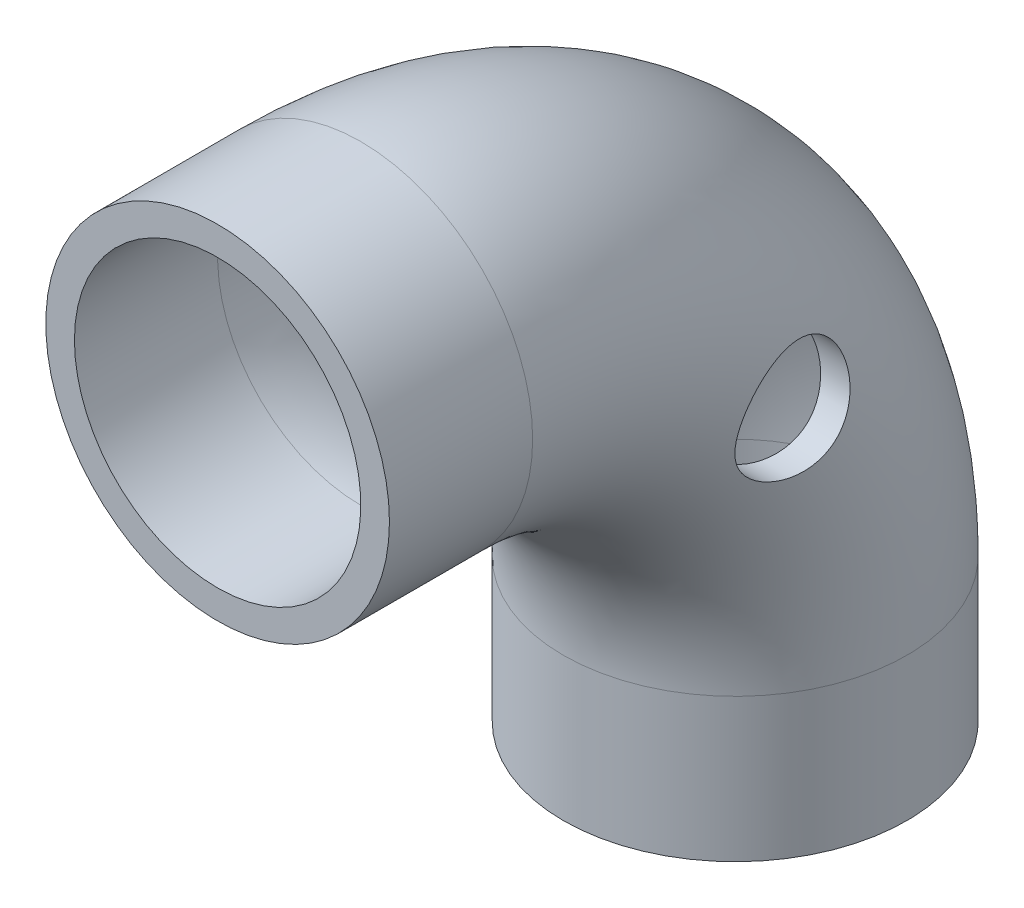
ISO-10303-21;
HEADER;
FILE_DESCRIPTION(('STEP AP214'),'2;1');
FILE_NAME('part.step','',(''),(''),'','','');
FILE_SCHEMA(('AUTOMOTIVE_DESIGN { 1 0 10303 214 1 1 1 1 }'));
ENDSEC;
DATA;
#1=APPLICATION_CONTEXT('core data for automotive mechanical design processes');
#2=APPLICATION_PROTOCOL_DEFINITION('international standard','automotive_design',2000,#1);
#3=PRODUCT_CONTEXT('',#1,'mechanical');
#4=PRODUCT('Part','Part','',(#3));
#5=PRODUCT_RELATED_PRODUCT_CATEGORY('part','',(#4));
#6=PRODUCT_DEFINITION_FORMATION('','',#4);
#7=PRODUCT_DEFINITION_CONTEXT('part definition',#1,'design');
#8=PRODUCT_DEFINITION('design','',#6,#7);
#9=PRODUCT_DEFINITION_SHAPE('','',#8);
#10=(LENGTH_UNIT() NAMED_UNIT(*) SI_UNIT(.MILLI.,.METRE.));
#11=(NAMED_UNIT(*) PLANE_ANGLE_UNIT() SI_UNIT($,.RADIAN.));
#12=(NAMED_UNIT(*) SI_UNIT($,.STERADIAN.) SOLID_ANGLE_UNIT());
#13=UNCERTAINTY_MEASURE_WITH_UNIT(LENGTH_MEASURE(1.E-05),#10,'distance_accuracy_value','');
#14=(GEOMETRIC_REPRESENTATION_CONTEXT(3) GLOBAL_UNCERTAINTY_ASSIGNED_CONTEXT((#13)) GLOBAL_UNIT_ASSIGNED_CONTEXT((#10,
#11,#12)) REPRESENTATION_CONTEXT('',''));
#15=CARTESIAN_POINT('',(0.,0.,0.));
#16=DIRECTION('',(0.,0.,1.));
#17=DIRECTION('',(1.,0.,0.));
#18=AXIS2_PLACEMENT_3D('',#15,#16,#17);
#19=CARTESIAN_POINT('',(0.,0.,0.));
#20=DIRECTION('',(0.,0.,-1.));
#21=DIRECTION('',(-1.,0.,0.));
#22=AXIS2_PLACEMENT_3D('',#19,#20,#21);
#23=PLANE('',#22);
#24=CARTESIAN_POINT('',(0.,30.4800000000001,0.));
#25=DIRECTION('',(0.,0.,-1.));
#26=DIRECTION('',(-1.,0.,0.));
#27=AXIS2_PLACEMENT_3D('',#24,#25,#26);
#28=CIRCLE('',#27,25.4000000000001);
#29=CARTESIAN_POINT('',(-25.4000000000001,30.4800000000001,0.));
#30=VERTEX_POINT('',#29);
#31=EDGE_CURVE('E125',#30,#30,#28,.F.);
#32=ORIENTED_EDGE('',*,*,#31,.F.);
#33=EDGE_LOOP('',(#32));
#34=FACE_BOUND('',#33,.T.);
#35=CARTESIAN_POINT('',(0.,30.4800000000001,0.));
#36=DIRECTION('',(0.,0.,1.));
#37=DIRECTION('',(1.,0.,0.));
#38=AXIS2_PLACEMENT_3D('',#35,#36,#37);
#39=CIRCLE('',#38,30.4800000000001);
#40=CARTESIAN_POINT('',(30.4800000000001,30.4800000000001,0.));
#41=VERTEX_POINT('',#40);
#42=EDGE_CURVE('E10',#41,#41,#39,.T.);
#43=ORIENTED_EDGE('',*,*,#42,.T.);
#44=EDGE_LOOP('',(#43));
#45=FACE_BOUND('',#44,.T.);
#46=ADVANCED_FACE('F45',(#34,#45),#23,.F.);
#47=CARTESIAN_POINT('',(0.,30.4800000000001,0.));
#48=DIRECTION('',(0.,0.,1.));
#49=DIRECTION('',(1.,0.,0.));
#50=AXIS2_PLACEMENT_3D('',#47,#48,#49);
#51=CYLINDRICAL_SURFACE('',#50,30.4800000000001);
#52=CARTESIAN_POINT('',(0.,30.4800000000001,-25.4));
#53=DIRECTION('',(0.,0.,-1.));
#54=DIRECTION('',(-1.,0.,0.));
#55=AXIS2_PLACEMENT_3D('',#52,#53,#54);
#56=CIRCLE('',#55,30.4800000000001);
#57=CARTESIAN_POINT('',(-30.4800000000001,30.4800000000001,-25.4));
#58=VERTEX_POINT('',#57);
#59=EDGE_CURVE('E65',#58,#58,#56,.T.);
#60=ORIENTED_EDGE('',*,*,#59,.F.);
#61=EDGE_LOOP('',(#60));
#62=FACE_BOUND('',#61,.T.);
#63=ORIENTED_EDGE('',*,*,#42,.F.);
#64=EDGE_LOOP('',(#63));
#65=FACE_BOUND('',#64,.T.);
#66=ADVANCED_FACE('F106',(#62,#65),#51,.T.);
#67=CARTESIAN_POINT('',(0.,-35.9210244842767,-25.3999999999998));
#68=DIRECTION('',(-1.,0.,0.));
#69=DIRECTION('',(0.,0.,1.));
#70=AXIS2_PLACEMENT_3D('',#67,#68,#69);
#71=TOROIDAL_SURFACE('',#70,66.4010244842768,30.4800000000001);
#72=CARTESIAN_POINT('',(-30.4689780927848,3.88097143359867,-79.5702494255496));
#73=CARTESIAN_POINT('',(-30.4762654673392,3.6861503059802,-79.3772379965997));
#74=CARTESIAN_POINT('',(-30.479977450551,3.49908839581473,-79.1762706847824));
#75=CARTESIAN_POINT('',(-30.4800223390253,3.14184741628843,-78.7598608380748));
#76=CARTESIAN_POINT('',(-30.476355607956,2.9716675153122,-78.544419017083));
#77=CARTESIAN_POINT('',(-30.4616046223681,2.64943083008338,-78.1006737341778));
#78=CARTESIAN_POINT('',(-30.4505214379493,2.49737143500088,-77.8723721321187));
#79=CARTESIAN_POINT('',(-30.4211001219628,2.21238547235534,-77.4045691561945));
#80=CARTESIAN_POINT('',(-30.4027618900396,2.07945916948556,-77.1650676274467));
#81=CARTESIAN_POINT('',(-30.3592192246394,1.83372408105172,-76.6769009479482));
#82=CARTESIAN_POINT('',(-30.3340224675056,1.72089303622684,-76.4282463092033));
#83=CARTESIAN_POINT('',(-30.2773126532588,1.5158095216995,-75.9232979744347));
#84=CARTESIAN_POINT('',(-30.2457996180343,1.42355698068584,-75.6670043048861));
#85=CARTESIAN_POINT('',(-30.1771980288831,1.26008522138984,-75.1485359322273));
#86=CARTESIAN_POINT('',(-30.1401095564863,1.18886569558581,-74.8863613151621));
#87=CARTESIAN_POINT('',(-30.0612456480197,1.06772179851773,-74.3577310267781));
#88=CARTESIAN_POINT('',(-30.0194683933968,1.01780572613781,-74.091273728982));
#89=CARTESIAN_POINT('',(-29.9312401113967,0.938518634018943,-73.5493911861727));
#90=CARTESIAN_POINT('',(-29.8847010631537,0.909668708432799,-73.2739040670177));
#91=CARTESIAN_POINT('',(-29.7890544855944,0.874531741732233,-72.721818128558));
#92=CARTESIAN_POINT('',(-29.7399458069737,0.868254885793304,-72.4452188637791));
#93=CARTESIAN_POINT('',(-29.6405409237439,0.878247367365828,-71.8926026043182));
#94=CARTESIAN_POINT('',(-29.5902445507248,0.894519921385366,-71.6165856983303));
#95=CARTESIAN_POINT('',(-29.4899270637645,0.949503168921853,-71.0667442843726));
#96=CARTESIAN_POINT('',(-29.4399059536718,0.988214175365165,-70.7929198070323));
#97=CARTESIAN_POINT('',(-29.3393428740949,1.09024718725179,-70.2362284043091));
#98=CARTESIAN_POINT('',(-29.2888869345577,1.15464046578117,-69.9535414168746));
#99=CARTESIAN_POINT('',(-29.1917258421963,1.3075223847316,-69.3942155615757));
#100=CARTESIAN_POINT('',(-29.1450192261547,1.39600156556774,-69.1175743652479));
#101=CARTESIAN_POINT('',(-29.0570766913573,1.59665824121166,-68.5721262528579));
#102=CARTESIAN_POINT('',(-29.0158405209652,1.70883464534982,-68.3033189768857));
#103=CARTESIAN_POINT('',(-28.9404777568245,1.95630642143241,-67.7755236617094));
#104=CARTESIAN_POINT('',(-28.9063508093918,2.09160064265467,-67.5165351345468));
#105=CARTESIAN_POINT('',(-28.8474683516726,2.38046329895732,-67.0174069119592));
#106=CARTESIAN_POINT('',(-28.8224809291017,2.53342685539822,-66.7769447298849));
#107=CARTESIAN_POINT('',(-28.7816453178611,2.85943693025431,-66.3092079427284));
#108=CARTESIAN_POINT('',(-28.7657969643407,3.03248308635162,-66.0819330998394));
#109=CARTESIAN_POINT('',(-28.7439390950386,3.39728359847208,-65.6425884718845));
#110=CARTESIAN_POINT('',(-28.7379251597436,3.5890295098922,-65.430511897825));
#111=CARTESIAN_POINT('',(-28.7359927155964,3.98973514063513,-65.0232579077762));
#112=CARTESIAN_POINT('',(-28.7400737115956,4.19869401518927,-64.8280796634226));
#113=CARTESIAN_POINT('',(-28.7575270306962,4.61727299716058,-64.4689014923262));
#114=CARTESIAN_POINT('',(-28.770247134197,4.82587736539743,-64.3036832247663));
#115=CARTESIAN_POINT('',(-28.8037993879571,5.25495511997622,-63.9903993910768));
#116=CARTESIAN_POINT('',(-28.8246311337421,5.47542791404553,-63.842332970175));
#117=CARTESIAN_POINT('',(-28.8736352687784,5.92667624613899,-63.5642301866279));
#118=CARTESIAN_POINT('',(-28.9018077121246,6.15745186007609,-63.4341939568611));
#119=CARTESIAN_POINT('',(-28.9645065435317,6.62783862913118,-63.1927844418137));
#120=CARTESIAN_POINT('',(-28.9990354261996,6.86745322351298,-63.08141851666));
#121=CARTESIAN_POINT('',(-29.0739889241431,7.35857157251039,-62.8759731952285));
#122=CARTESIAN_POINT('',(-29.1145135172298,7.61021497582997,-62.782264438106));
#123=CARTESIAN_POINT('',(-29.1996335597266,8.11960330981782,-62.6151705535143));
#124=CARTESIAN_POINT('',(-29.2442307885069,8.37735087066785,-62.5417943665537));
#125=CARTESIAN_POINT('',(-29.3360998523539,8.89739743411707,-62.4156929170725));
#126=CARTESIAN_POINT('',(-29.3833718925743,9.15969678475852,-62.3629692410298));
#127=CARTESIAN_POINT('',(-29.4791995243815,9.68740869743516,-62.2783806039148));
#128=CARTESIAN_POINT('',(-29.5277551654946,9.95282137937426,-62.2465164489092));
#129=CARTESIAN_POINT('',(-29.62825244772,10.5043451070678,-62.2022699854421));
#130=CARTESIAN_POINT('',(-29.6801887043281,10.7905828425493,-62.191438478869));
#131=CARTESIAN_POINT('',(-29.7823592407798,11.3631519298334,-62.1939926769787));
#132=CARTESIAN_POINT('',(-29.8325940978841,11.6494832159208,-62.2073700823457));
#133=CARTESIAN_POINT('',(-29.9299049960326,12.2205948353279,-62.2583553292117));
#134=CARTESIAN_POINT('',(-29.9769803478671,12.5053748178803,-62.2959684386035));
#135=CARTESIAN_POINT('',(-30.0666061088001,13.0714159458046,-62.3953422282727));
#136=CARTESIAN_POINT('',(-30.1091566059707,13.3526771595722,-62.4571024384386));
#137=CARTESIAN_POINT('',(-30.1886359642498,13.9103363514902,-62.6047021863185));
#138=CARTESIAN_POINT('',(-30.2255517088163,14.1867216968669,-62.6905966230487));
#139=CARTESIAN_POINT('',(-30.292641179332,14.7318824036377,-62.8859745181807));
#140=CARTESIAN_POINT('',(-30.3228148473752,15.0006576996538,-62.995458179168));
#141=CARTESIAN_POINT('',(-30.3756300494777,15.5283834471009,-63.2373159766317));
#142=CARTESIAN_POINT('',(-30.3982738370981,15.7873368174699,-63.3696832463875));
#143=CARTESIAN_POINT('',(-30.4355024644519,16.2933675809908,-63.6564168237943));
#144=CARTESIAN_POINT('',(-30.4500876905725,16.5404455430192,-63.8107820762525));
#145=CARTESIAN_POINT('',(-30.4703873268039,17.0083742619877,-64.131908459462));
#146=CARTESIAN_POINT('',(-30.4765172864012,17.2299201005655,-64.2976317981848));
#147=CARTESIAN_POINT('',(-30.4812468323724,17.6588000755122,-64.6466353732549));
#148=CARTESIAN_POINT('',(-30.4798466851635,17.866134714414,-64.8299149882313));
#149=CARTESIAN_POINT('',(-30.469692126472,18.2650569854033,-65.2126591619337));
#150=CARTESIAN_POINT('',(-30.46093819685,18.4566456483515,-65.4121226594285));
#151=CARTESIAN_POINT('',(-30.4364374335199,18.8227370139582,-65.8257540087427));
#152=CARTESIAN_POINT('',(-30.420690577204,18.9972396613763,-66.0399219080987));
#153=CARTESIAN_POINT('',(-30.3830364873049,19.325295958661,-66.4777815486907));
#154=CARTESIAN_POINT('',(-30.3612335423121,19.4791440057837,-66.7012619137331));
#155=CARTESIAN_POINT('',(-30.3119857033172,19.7682873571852,-67.1594333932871));
#156=CARTESIAN_POINT('',(-30.2845387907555,19.9035759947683,-67.3941284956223));
#157=CARTESIAN_POINT('',(-30.2247414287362,20.1547563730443,-67.8730446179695));
#158=CARTESIAN_POINT('',(-30.1923914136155,20.2706498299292,-68.1172647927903));
#159=CARTESIAN_POINT('',(-30.1235951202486,20.4824492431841,-68.6136721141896));
#160=CARTESIAN_POINT('',(-30.0871486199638,20.5783541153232,-68.865859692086));
#161=CARTESIAN_POINT('',(-30.009710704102,20.7526640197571,-69.3854626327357));
#162=CARTESIAN_POINT('',(-29.9686056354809,20.8303483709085,-69.6531029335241));
#163=CARTESIAN_POINT('',(-29.8839482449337,20.9634205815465,-70.1934974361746));
#164=CARTESIAN_POINT('',(-29.8403958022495,21.0188073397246,-70.4662518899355));
#165=CARTESIAN_POINT('',(-29.7518731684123,21.1070186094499,-71.0152135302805));
#166=CARTESIAN_POINT('',(-29.7069026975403,21.1398386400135,-71.2914213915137));
#167=CARTESIAN_POINT('',(-29.6166031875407,21.1827331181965,-71.8455406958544));
#168=CARTESIAN_POINT('',(-29.5712741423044,21.1928071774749,-72.1234521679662));
#169=CARTESIAN_POINT('',(-29.4796485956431,21.1900900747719,-72.6895370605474));
#170=CARTESIAN_POINT('',(-29.4333780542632,21.1764420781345,-72.9777110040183));
#171=CARTESIAN_POINT('',(-29.3427580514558,21.1246624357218,-73.552026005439));
#172=CARTESIAN_POINT('',(-29.2984077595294,21.0865414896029,-73.83816789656));
#173=CARTESIAN_POINT('',(-29.212707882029,20.9859644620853,-74.4067354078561));
#174=CARTESIAN_POINT('',(-29.1713595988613,20.9234978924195,-74.6891593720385));
#175=CARTESIAN_POINT('',(-29.0927672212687,20.7745639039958,-75.2480708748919));
#176=CARTESIAN_POINT('',(-29.055521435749,20.6881064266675,-75.5245608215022));
#177=CARTESIAN_POINT('',(-28.9863276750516,20.4923005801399,-76.0679068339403));
#178=CARTESIAN_POINT('',(-28.9543462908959,20.3831073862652,-76.3348145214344));
#179=CARTESIAN_POINT('',(-28.8962409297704,20.1421396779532,-76.8589067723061));
#180=CARTESIAN_POINT('',(-28.8701169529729,20.0103651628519,-77.1160913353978));
#181=CARTESIAN_POINT('',(-28.8244505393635,19.7251324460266,-77.6186746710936));
#182=CARTESIAN_POINT('',(-28.8049064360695,19.5716797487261,-77.8640764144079));
#183=CARTESIAN_POINT('',(-28.7729410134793,19.2441522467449,-78.3411992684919));
#184=CARTESIAN_POINT('',(-28.7605194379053,19.0700781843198,-78.5729208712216));
#185=CARTESIAN_POINT('',(-28.7434965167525,18.7098973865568,-79.0119389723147));
#186=CARTESIAN_POINT('',(-28.7386050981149,18.5245396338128,-79.2198392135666));
#187=CARTESIAN_POINT('',(-28.7358475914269,18.1373580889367,-79.6197402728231));
#188=CARTESIAN_POINT('',(-28.7379813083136,17.9355347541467,-79.8117415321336));
#189=CARTESIAN_POINT('',(-28.7492165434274,17.5169382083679,-80.1784230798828));
#190=CARTESIAN_POINT('',(-28.7583174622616,17.3001662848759,-80.3531048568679));
#191=CARTESIAN_POINT('',(-28.7832451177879,16.8532781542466,-80.6839313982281));
#192=CARTESIAN_POINT('',(-28.7990718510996,16.6231619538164,-80.8400761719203));
#193=CARTESIAN_POINT('',(-28.8367201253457,16.1552311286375,-81.1303389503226));
#194=CARTESIAN_POINT('',(-28.8584373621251,15.917608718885,-81.2647806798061));
#195=CARTESIAN_POINT('',(-28.9074447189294,15.4326954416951,-81.5139578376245));
#196=CARTESIAN_POINT('',(-28.9347368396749,15.185401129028,-81.6286861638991));
#197=CARTESIAN_POINT('',(-28.9942250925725,14.6829337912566,-81.8377255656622));
#198=CARTESIAN_POINT('',(-29.0264207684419,14.4277615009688,-81.932038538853));
#199=CARTESIAN_POINT('',(-29.094958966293,13.911180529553,-82.0997843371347));
#200=CARTESIAN_POINT('',(-29.1313017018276,13.6497715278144,-82.173216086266));
#201=CARTESIAN_POINT('',(-29.2083949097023,13.1147530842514,-82.3006709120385));
#202=CARTESIAN_POINT('',(-29.2492424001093,12.8410093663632,-82.3540718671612));
#203=CARTESIAN_POINT('',(-29.3334679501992,12.2904354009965,-82.4381720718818));
#204=CARTESIAN_POINT('',(-29.3768461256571,12.013605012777,-82.4688702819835));
#205=CARTESIAN_POINT('',(-29.46512277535,11.4585503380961,-82.5074515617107));
#206=CARTESIAN_POINT('',(-29.5100215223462,11.1803258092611,-82.5153305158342));
#207=CARTESIAN_POINT('',(-29.6002889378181,10.6242423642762,-82.5082531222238));
#208=CARTESIAN_POINT('',(-29.6456576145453,10.3463834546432,-82.4932963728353));
#209=CARTESIAN_POINT('',(-29.7374241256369,9.78282260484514,-82.4396921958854));
#210=CARTESIAN_POINT('',(-29.7838007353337,9.49719557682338,-82.4002166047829));
#211=CARTESIAN_POINT('',(-29.8747383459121,8.93017662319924,-82.2970936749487));
#212=CARTESIAN_POINT('',(-29.9193001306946,8.64878290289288,-82.2334568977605));
#213=CARTESIAN_POINT('',(-30.0055046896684,8.09186454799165,-82.082306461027));
#214=CARTESIAN_POINT('',(-30.0471460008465,7.8163429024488,-81.9947809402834));
#215=CARTESIAN_POINT('',(-30.1263587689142,7.27335661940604,-81.7963847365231));
#216=CARTESIAN_POINT('',(-30.1639318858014,7.00588872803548,-81.685523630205));
#217=CARTESIAN_POINT('',(-30.2341526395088,6.47955107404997,-81.4404757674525));
#218=CARTESIAN_POINT('',(-30.2667751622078,6.22073002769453,-81.3061770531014));
#219=CARTESIAN_POINT('',(-30.3258991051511,5.71506309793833,-81.0154772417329));
#220=CARTESIAN_POINT('',(-30.3524004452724,5.46821737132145,-80.8590758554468));
#221=CARTESIAN_POINT('',(-30.3984231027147,4.98856098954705,-80.5252971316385));
#222=CARTESIAN_POINT('',(-30.4179467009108,4.75574576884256,-80.3479266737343));
#223=CARTESIAN_POINT('',(-30.4493321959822,4.30599423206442,-79.9734785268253));
#224=CARTESIAN_POINT('',(-30.4611945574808,4.08905695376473,-79.7764020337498));
#225=CARTESIAN_POINT('',(-30.4689780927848,3.88097143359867,-79.5702494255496));
#226=B_SPLINE_CURVE_WITH_KNOTS('',3,(#72,#73,#74,#75,#76,#77,#78,#79,#80,#81,#82,#83,#84,#85,
#86,#87,#88,#89,#90,#91,#92,#93,#94,#95,#96,#97,#98,#99,#100,#101,#102,#103,#104,#105,#106,#107,
#108,#109,#110,#111,#112,#113,#114,#115,#116,#117,#118,#119,#120,#121,#122,#123,#124,#125,#126,
#127,#128,#129,#130,#131,#132,#133,#134,#135,#136,#137,#138,#139,#140,#141,#142,#143,#144,#145,
#146,#147,#148,#149,#150,#151,#152,#153,#154,#155,#156,#157,#158,#159,#160,#161,#162,#163,#164,
#165,#166,#167,#168,#169,#170,#171,#172,#173,#174,#175,#176,#177,#178,#179,#180,#181,#182,#183,
#184,#185,#186,#187,#188,#189,#190,#191,#192,#193,#194,#195,#196,#197,#198,#199,#200,#201,#202,
#203,#204,#205,#206,#207,#208,#209,#210,#211,#212,#213,#214,#215,#216,#217,#218,#219,#220,#221,
#222,#223,#224,#225),.UNSPECIFIED.,.T.,.F.,(4,2,2,2,2,2,2,2,2,2,2,2,2,2,2,2,2,2,2,2,2,2,2,2,2,2,
2,2,2,2,2,2,2,2,2,2,2,2,2,2,2,2,2,2,2,2,2,2,2,2,2,2,2,2,2,2,2,2,2,2,2,2,2,2,2,2,2,2,2,2,2,2,2,2,
2,2,4),(0.,0.822752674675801,1.64546480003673,2.46805824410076,3.2906630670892,4.11235095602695,
4.93403599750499,5.7557090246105,6.57770184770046,7.41939602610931,8.26146993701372,
9.10366397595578,9.94586976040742,10.8276619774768,11.7091083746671,12.5905142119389,
13.4718761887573,14.3289999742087,15.1861082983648,16.0428313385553,16.8995123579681,
17.6978051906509,18.4960582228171,19.2943171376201,20.0928900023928,20.9067096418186,
21.7208865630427,22.5351260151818,23.3493969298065,24.2217171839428,25.0937384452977,
25.9659493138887,26.8381432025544,27.7123373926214,28.5865390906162,29.4604789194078,
30.3343768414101,31.1635788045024,31.9927514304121,32.821869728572,33.6509907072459,
34.4666354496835,35.2825724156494,36.0984371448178,36.9143461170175,37.7584981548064,
38.6026918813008,39.4470531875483,40.291428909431,41.1669403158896,42.0420692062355,
42.9175755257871,43.7927195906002,44.6620757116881,45.531431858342,46.4005676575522,
47.269672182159,48.1043765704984,48.939057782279,49.7736671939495,50.6082761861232,
51.4289757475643,52.2499703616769,53.0708886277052,53.8918491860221,54.7365313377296,
55.5812521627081,56.4261253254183,57.2710133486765,58.1461187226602,59.0208420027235,
59.8960003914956,60.7708003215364,61.6498995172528,62.5290102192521,63.4078332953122,
64.2866030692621),.UNSPECIFIED.);
#227=CARTESIAN_POINT('',(-30.4689780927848,3.88097143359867,-79.5702494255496));
#228=VERTEX_POINT('',#227);
#229=EDGE_CURVE('E96',#228,#228,#226,.T.);
#230=ORIENTED_EDGE('',*,*,#229,.F.);
#231=EDGE_LOOP('',(#230));
#232=FACE_BOUND('',#231,.T.);
#233=CARTESIAN_POINT('',(30.4689780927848,3.88097143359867,-79.5702494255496));
#234=CARTESIAN_POINT('',(30.4615234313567,4.08027046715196,-79.7676976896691));
#235=CARTESIAN_POINT('',(30.4503276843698,4.28768532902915,-79.9568166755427));
#236=CARTESIAN_POINT('',(30.4208875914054,4.71714616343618,-80.3170325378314));
#237=CARTESIAN_POINT('',(30.4026430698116,4.93919250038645,-80.4881289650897));
#238=CARTESIAN_POINT('',(30.3596994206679,5.39627727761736,-80.8111717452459));
#239=CARTESIAN_POINT('',(30.3349989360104,5.63131844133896,-80.9631140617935));
#240=CARTESIAN_POINT('',(30.2798791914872,6.11261678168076,-81.2468455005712));
#241=CARTESIAN_POINT('',(30.249459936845,6.35887394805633,-81.3786346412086));
#242=CARTESIAN_POINT('',(30.1838094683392,6.86035081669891,-81.6210433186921));
#243=CARTESIAN_POINT('',(30.1485880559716,7.11555149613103,-81.7317049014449));
#244=CARTESIAN_POINT('',(30.0741880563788,7.63374678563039,-81.9316237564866));
#245=CARTESIAN_POINT('',(30.035008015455,7.8967442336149,-82.0208731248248));
#246=CARTESIAN_POINT('',(29.953678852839,8.42869736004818,-82.1774512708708));
#247=CARTESIAN_POINT('',(29.9115300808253,8.69765233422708,-82.2447826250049));
#248=CARTESIAN_POINT('',(29.8252672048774,9.23986761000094,-82.3572134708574));
#249=CARTESIAN_POINT('',(29.7811530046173,9.51312812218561,-82.4023118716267));
#250=CARTESIAN_POINT('',(29.6906386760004,10.0705990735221,-82.47108009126));
#251=CARTESIAN_POINT('',(29.6442097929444,10.3548903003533,-82.4940587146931));
#252=CARTESIAN_POINT('',(29.5514966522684,10.924424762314,-82.5160458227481));
#253=CARTESIAN_POINT('',(29.5052123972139,11.2096680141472,-82.5150538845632));
#254=CARTESIAN_POINT('',(29.41391122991,11.779305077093,-82.4890746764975));
#255=CARTESIAN_POINT('',(29.3688944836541,12.0636987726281,-82.4640842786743));
#256=CARTESIAN_POINT('',(29.2812418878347,12.6297268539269,-82.3901949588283));
#257=CARTESIAN_POINT('',(29.2386059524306,12.9113613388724,-82.3412968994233));
#258=CARTESIAN_POINT('',(29.1562475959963,13.473599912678,-82.219023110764));
#259=CARTESIAN_POINT('',(29.1165699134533,13.7541437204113,-82.1453394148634));
#260=CARTESIAN_POINT('',(29.0417998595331,14.308349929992,-81.9740765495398));
#261=CARTESIAN_POINT('',(29.0067056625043,14.5820150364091,-81.8765069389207));
#262=CARTESIAN_POINT('',(28.9420254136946,15.1205446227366,-81.658015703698));
#263=CARTESIAN_POINT('',(28.9124394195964,15.3854090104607,-81.5370938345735));
#264=CARTESIAN_POINT('',(28.859593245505,15.9042736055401,-81.272666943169));
#265=CARTESIAN_POINT('',(28.8363328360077,16.158274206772,-81.1291627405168));
#266=CARTESIAN_POINT('',(28.7974393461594,16.6453008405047,-80.82560035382));
#267=CARTESIAN_POINT('',(28.781582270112,16.8787407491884,-80.6662346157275));
#268=CARTESIAN_POINT('',(28.7568300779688,17.3317621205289,-80.3284071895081));
#269=CARTESIAN_POINT('',(28.7479348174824,17.5513438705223,-80.1499458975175));
#270=CARTESIAN_POINT('',(28.737350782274,17.9749142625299,-79.7752683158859));
#271=CARTESIAN_POINT('',(28.7356607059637,18.1789057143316,-79.5790552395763));
#272=CARTESIAN_POINT('',(28.7395302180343,18.5697753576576,-79.1703355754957));
#273=CARTESIAN_POINT('',(28.745089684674,18.7566538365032,-78.9578292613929));
#274=CARTESIAN_POINT('',(28.7630172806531,19.1063067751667,-78.5250925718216));
#275=CARTESIAN_POINT('',(28.7751654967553,19.269654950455,-78.305316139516));
#276=CARTESIAN_POINT('',(28.8058065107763,19.5778984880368,-77.8536123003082));
#277=CARTESIAN_POINT('',(28.8242991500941,19.7227943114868,-77.621685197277));
#278=CARTESIAN_POINT('',(28.8671619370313,19.9932038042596,-77.1473619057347));
#279=CARTESIAN_POINT('',(28.8915312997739,20.1187200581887,-76.9049671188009));
#280=CARTESIAN_POINT('',(28.9455601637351,20.3497031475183,-76.4112690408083));
#281=CARTESIAN_POINT('',(28.9752216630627,20.4551623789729,-76.1599624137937));
#282=CARTESIAN_POINT('',(29.0395319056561,20.6466398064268,-75.6469071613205));
#283=CARTESIAN_POINT('',(29.0742403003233,20.7323883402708,-75.3850654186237));
#284=CARTESIAN_POINT('',(29.1475329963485,20.8822744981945,-74.8556797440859));
#285=CARTESIAN_POINT('',(29.1861189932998,20.9464026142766,-74.5881333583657));
#286=CARTESIAN_POINT('',(29.266248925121,21.0527058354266,-74.0491658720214));
#287=CARTESIAN_POINT('',(29.3077927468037,21.0948817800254,-73.7777449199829));
#288=CARTESIAN_POINT('',(29.3928864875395,21.157118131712,-73.2326888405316));
#289=CARTESIAN_POINT('',(29.4364364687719,21.1771778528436,-72.959053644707));
#290=CARTESIAN_POINT('',(29.5263091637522,21.1954736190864,-72.400319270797));
#291=CARTESIAN_POINT('',(29.57267326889,21.1928100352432,-72.1151969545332));
#292=CARTESIAN_POINT('',(29.6653731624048,21.163541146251,-71.5461837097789));
#293=CARTESIAN_POINT('',(29.7117089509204,21.1369359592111,-71.2622927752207));
#294=CARTESIAN_POINT('',(29.8032265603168,21.0599244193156,-70.6975165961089));
#295=CARTESIAN_POINT('',(29.8484081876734,21.009514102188,-70.4166318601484));
#296=CARTESIAN_POINT('',(29.9364836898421,20.8851519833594,-69.8597629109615));
#297=CARTESIAN_POINT('',(29.9793776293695,20.8112008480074,-69.5837785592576));
#298=CARTESIAN_POINT('',(30.0623413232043,20.6389801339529,-69.034857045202));
#299=CARTESIAN_POINT('',(30.1023649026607,20.540394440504,-68.7620119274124));
#300=CARTESIAN_POINT('',(30.1778271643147,20.3200317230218,-68.2253192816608));
#301=CARTESIAN_POINT('',(30.2132676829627,20.1982640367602,-67.9614681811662));
#302=CARTESIAN_POINT('',(30.2785646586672,19.9322447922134,-67.4446190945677));
#303=CARTESIAN_POINT('',(30.3084210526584,19.7879929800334,-67.1916212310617));
#304=CARTESIAN_POINT('',(30.3616330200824,19.4779505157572,-66.6984640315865));
#305=CARTESIAN_POINT('',(30.3849888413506,19.3121606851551,-66.458304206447));
#306=CARTESIAN_POINT('',(30.4237663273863,18.9660774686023,-66.0005217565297));
#307=CARTESIAN_POINT('',(30.4394263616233,18.7864511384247,-65.7824148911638));
#308=CARTESIAN_POINT('',(30.4633976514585,18.4094301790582,-65.3617023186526));
#309=CARTESIAN_POINT('',(30.4717090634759,18.2120359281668,-65.1590962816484));
#310=CARTESIAN_POINT('',(30.4806127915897,17.8009944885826,-64.7710160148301));
#311=CARTESIAN_POINT('',(30.4812069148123,17.5873511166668,-64.5855377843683));
#312=CARTESIAN_POINT('',(30.4745155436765,17.1454205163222,-64.2330979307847));
#313=CARTESIAN_POINT('',(30.4672302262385,16.9171336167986,-64.0661358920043));
#314=CARTESIAN_POINT('',(30.4452516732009,16.4563824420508,-63.7577779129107));
#315=CARTESIAN_POINT('',(30.430841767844,16.2243833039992,-63.6156658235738));
#316=CARTESIAN_POINT('',(30.3950198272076,15.7501640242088,-63.3507020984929));
#317=CARTESIAN_POINT('',(30.3736079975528,15.5079441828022,-63.2278498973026));
#318=CARTESIAN_POINT('',(30.324227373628,15.0150096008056,-63.0021356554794));
#319=CARTESIAN_POINT('',(30.2962584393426,14.764294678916,-62.899274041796));
#320=CARTESIAN_POINT('',(30.2343944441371,14.2561061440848,-62.7140857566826));
#321=CARTESIAN_POINT('',(30.2004992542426,13.9986323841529,-62.631759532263));
#322=CARTESIAN_POINT('',(30.1271285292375,13.4753898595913,-62.4871174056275));
#323=CARTESIAN_POINT('',(30.0875887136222,13.2095577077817,-62.4250636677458));
#324=CARTESIAN_POINT('',(30.0042426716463,12.6744204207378,-62.3226131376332));
#325=CARTESIAN_POINT('',(29.960436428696,12.4051152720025,-62.2822164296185));
#326=CARTESIAN_POINT('',(29.8696748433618,11.8646214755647,-62.2231736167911));
#327=CARTESIAN_POINT('',(29.8227190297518,11.5934325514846,-62.2045307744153));
#328=CARTESIAN_POINT('',(29.7268873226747,11.0506788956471,-62.1890044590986));
#329=CARTESIAN_POINT('',(29.6780107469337,10.7791140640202,-62.1921287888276));
#330=CARTESIAN_POINT('',(29.5771544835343,10.2232557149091,-62.2208046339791));
#331=CARTESIAN_POINT('',(29.5251445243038,9.9390261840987,-62.247501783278));
#332=CARTESIAN_POINT('',(29.4221247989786,9.37362919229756,-62.3247444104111));
#333=CARTESIAN_POINT('',(29.3711150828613,9.09246188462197,-62.3752910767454));
#334=CARTESIAN_POINT('',(29.2717677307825,8.53483422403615,-62.5000283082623));
#335=CARTESIAN_POINT('',(29.2234309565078,8.25837540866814,-62.5742264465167));
#336=CARTESIAN_POINT('',(29.131160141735,7.7121446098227,-62.745908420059));
#337=CARTESIAN_POINT('',(29.0872243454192,7.44236999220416,-62.8433829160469));
#338=CARTESIAN_POINT('',(29.0050179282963,6.90894747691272,-63.0621237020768));
#339=CARTESIAN_POINT('',(28.9667995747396,6.6453727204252,-63.1835884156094));
#340=CARTESIAN_POINT('',(28.898032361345,6.12878993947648,-63.4491051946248));
#341=CARTESIAN_POINT('',(28.8674835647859,5.87578200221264,-63.5931574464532));
#342=CARTESIAN_POINT('',(28.8153822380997,5.382560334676,-63.9028338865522));
#343=CARTESIAN_POINT('',(28.7938240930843,5.14233870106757,-64.0684445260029));
#344=CARTESIAN_POINT('',(28.7606479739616,4.67661220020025,-64.4200884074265));
#345=CARTESIAN_POINT('',(28.7490292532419,4.45110622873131,-64.6061201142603));
#346=CARTESIAN_POINT('',(28.7367026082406,4.03169473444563,-64.9836836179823));
#347=CARTESIAN_POINT('',(28.7353017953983,3.83668271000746,-65.1739656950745));
#348=CARTESIAN_POINT('',(28.7416409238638,3.46264678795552,-65.569490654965));
#349=CARTESIAN_POINT('',(28.7493804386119,3.28362214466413,-65.7747328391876));
#350=CARTESIAN_POINT('',(28.7736871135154,2.94285216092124,-66.1986019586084));
#351=CARTESIAN_POINT('',(28.7902545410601,2.78110734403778,-66.417229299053));
#352=CARTESIAN_POINT('',(28.8315616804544,2.47597553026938,-66.8662013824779));
#353=CARTESIAN_POINT('',(28.8563014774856,2.3325887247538,-67.0965462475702));
#354=CARTESIAN_POINT('',(28.9123552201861,2.06811532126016,-67.5618245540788));
#355=CARTESIAN_POINT('',(28.943504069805,1.94659003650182,-67.7965290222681));
#356=CARTESIAN_POINT('',(29.0116366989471,1.72242134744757,-68.27406395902));
#357=CARTESIAN_POINT('',(29.0486225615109,1.61978471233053,-68.5168973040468));
#358=CARTESIAN_POINT('',(29.127214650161,1.43387924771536,-69.0091479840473));
#359=CARTESIAN_POINT('',(29.1688211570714,1.35061159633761,-69.2585657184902));
#360=CARTESIAN_POINT('',(29.2553713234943,1.20376411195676,-69.7625683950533));
#361=CARTESIAN_POINT('',(29.3003151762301,1.14018541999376,-70.0171536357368));
#362=CARTESIAN_POINT('',(29.3953228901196,1.02934252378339,-70.5473872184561));
#363=CARTESIAN_POINT('',(29.4455278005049,0.983463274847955,-70.8233005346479));
#364=CARTESIAN_POINT('',(29.5466472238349,0.914614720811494,-71.3777234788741));
#365=CARTESIAN_POINT('',(29.5975614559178,0.891636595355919,-71.656232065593));
#366=CARTESIAN_POINT('',(29.6986278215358,0.868685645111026,-72.214521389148));
#367=CARTESIAN_POINT('',(29.7487794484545,0.868727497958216,-72.4943028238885));
#368=CARTESIAN_POINT('',(29.8468239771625,0.891916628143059,-73.0531975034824));
#369=CARTESIAN_POINT('',(29.89471771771,0.915055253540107,-73.3323109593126));
#370=CARTESIAN_POINT('',(29.9886498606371,0.985700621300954,-73.8986153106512));
#371=CARTESIAN_POINT('',(30.0345528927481,1.03408214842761,-74.1857202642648));
#372=CARTESIAN_POINT('',(30.1211790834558,1.15552365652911,-74.7554779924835));
#373=CARTESIAN_POINT('',(30.1619020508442,1.22858454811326,-75.038130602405));
#374=CARTESIAN_POINT('',(30.2370008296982,1.39902284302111,-75.5967616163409));
#375=CARTESIAN_POINT('',(30.2713790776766,1.4963908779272,-75.8727425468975));
#376=CARTESIAN_POINT('',(30.3328697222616,1.71490847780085,-76.4159544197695));
#377=CARTESIAN_POINT('',(30.3599826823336,1.83605619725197,-76.6831860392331));
#378=CARTESIAN_POINT('',(30.4045014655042,2.09128705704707,-77.1868838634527));
#379=CARTESIAN_POINT('',(30.4224865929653,2.22369761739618,-77.424147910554));
#380=CARTESIAN_POINT('',(30.4513125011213,2.50731665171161,-77.8876085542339));
#381=CARTESIAN_POINT('',(30.4621537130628,2.65852399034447,-78.1138058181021));
#382=CARTESIAN_POINT('',(30.4765381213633,2.97870660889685,-78.5534707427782));
#383=CARTESIAN_POINT('',(30.4800819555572,3.14768033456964,-78.7669395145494));
#384=CARTESIAN_POINT('',(30.4799151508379,3.50221747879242,-79.1796311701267));
#385=CARTESIAN_POINT('',(30.4762042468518,3.68778150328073,-79.3788535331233));
#386=CARTESIAN_POINT('',(30.4689780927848,3.88097143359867,-79.5702494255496));
#387=B_SPLINE_CURVE_WITH_KNOTS('',3,(#233,#234,#235,#236,#237,#238,#239,#240,#241,#242,#243,
#244,#245,#246,#247,#248,#249,#250,#251,#252,#253,#254,#255,#256,#257,#258,#259,#260,#261,#262,
#263,#264,#265,#266,#267,#268,#269,#270,#271,#272,#273,#274,#275,#276,#277,#278,#279,#280,#281,
#282,#283,#284,#285,#286,#287,#288,#289,#290,#291,#292,#293,#294,#295,#296,#297,#298,#299,#300,
#301,#302,#303,#304,#305,#306,#307,#308,#309,#310,#311,#312,#313,#314,#315,#316,#317,#318,#319,
#320,#321,#322,#323,#324,#325,#326,#327,#328,#329,#330,#331,#332,#333,#334,#335,#336,#337,#338,
#339,#340,#341,#342,#343,#344,#345,#346,#347,#348,#349,#350,#351,#352,#353,#354,#355,#356,#357,
#358,#359,#360,#361,#362,#363,#364,#365,#366,#367,#368,#369,#370,#371,#372,#373,#374,#375,#376,
#377,#378,#379,#380,#381,#382,#383,#384,#385,#386),.UNSPECIFIED.,.T.,.F.,(4,2,2,2,2,2,2,2,2,2,2,
2,2,2,2,2,2,2,2,2,2,2,2,2,2,2,2,2,2,2,2,2,2,2,2,2,2,2,2,2,2,2,2,2,2,2,2,2,2,2,2,2,2,2,2,2,2,2,2,
2,2,2,2,2,2,2,2,2,2,2,2,2,2,2,2,2,4),(0.,0.841677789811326,1.68337655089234,2.52525238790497,
3.36712745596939,4.20730923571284,5.04780067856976,5.88819328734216,6.72862712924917,
7.59454368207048,8.46047550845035,9.32652021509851,10.1925336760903,11.0697314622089,
11.946578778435,12.8234352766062,13.7002599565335,14.5484908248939,15.3967041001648,
16.244764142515,17.0928099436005,17.9141513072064,18.7354721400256,19.556683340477,
20.3782052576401,21.2103738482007,22.0429079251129,22.8754101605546,23.7079382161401,
24.5735749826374,25.4392074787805,26.3049841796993,27.1707363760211,28.048226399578,
28.9253637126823,29.802510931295,30.6796247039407,31.5275221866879,32.3754016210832,
33.2230825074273,34.0707443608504,34.887121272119,35.7034742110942,36.5198445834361,
37.3362327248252,38.1627950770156,38.9893606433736,39.8160501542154,40.6430360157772,
41.5125712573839,42.3821498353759,43.2520071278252,44.1215159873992,44.9985428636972,
45.8755769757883,46.7520625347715,47.6284822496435,48.4448656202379,49.2612108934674,
50.0775808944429,50.8939594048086,51.6914762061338,52.4892782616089,53.2871288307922,
54.0850256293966,54.9365895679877,55.7878254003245,56.6396039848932,57.4910636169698,
58.3742092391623,59.2573874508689,60.1402257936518,61.0229956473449,61.8389643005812,
62.654883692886,63.4707317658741,64.2866096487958),.UNSPECIFIED.);
#388=CARTESIAN_POINT('',(30.4689780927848,3.88097143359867,-79.5702494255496));
#389=VERTEX_POINT('',#388);
#390=EDGE_CURVE('E89',#389,#389,#387,.T.);
#391=ORIENTED_EDGE('',*,*,#390,.F.);
#392=EDGE_LOOP('',(#391));
#393=FACE_BOUND('',#392,.T.);
#394=CARTESIAN_POINT('',(0.,-35.9210244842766,-91.8010244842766));
#395=DIRECTION('',(0.,-1.,0.));
#396=DIRECTION('',(-1.,0.,0.));
#397=AXIS2_PLACEMENT_3D('',#394,#395,#396);
#398=CIRCLE('',#397,30.4800000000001);
#399=CARTESIAN_POINT('',(-30.4800000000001,-35.9210244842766,-91.8010244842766));
#400=VERTEX_POINT('',#399);
#401=EDGE_CURVE('E58',#400,#400,#398,.T.);
#402=ORIENTED_EDGE('',*,*,#401,.F.);
#403=EDGE_LOOP('',(#402));
#404=FACE_BOUND('',#403,.T.);
#405=ORIENTED_EDGE('',*,*,#59,.T.);
#406=EDGE_LOOP('',(#405));
#407=FACE_BOUND('',#406,.T.);
#408=ADVANCED_FACE('F101',(#232,#393,#404,#407),#71,.T.);
#409=CARTESIAN_POINT('',(0.,-35.9210244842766,-91.8010244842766));
#410=DIRECTION('',(0.,1.,0.));
#411=DIRECTION('',(0.,0.,1.));
#412=AXIS2_PLACEMENT_3D('',#409,#410,#411);
#413=CYLINDRICAL_SURFACE('',#412,30.48);
#414=CARTESIAN_POINT('',(0.,-61.3210244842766,-91.8010244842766));
#415=DIRECTION('',(0.,1.,0.));
#416=DIRECTION('',(0.,0.,1.));
#417=AXIS2_PLACEMENT_3D('',#414,#415,#416);
#418=CIRCLE('',#417,30.48);
#419=CARTESIAN_POINT('',(0.,-61.3210244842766,-61.3210244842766));
#420=VERTEX_POINT('',#419);
#421=EDGE_CURVE('E120',#420,#420,#418,.T.);
#422=ORIENTED_EDGE('',*,*,#421,.T.);
#423=EDGE_LOOP('',(#422));
#424=FACE_BOUND('',#423,.T.);
#425=ORIENTED_EDGE('',*,*,#401,.T.);
#426=EDGE_LOOP('',(#425));
#427=FACE_BOUND('',#426,.T.);
#428=ADVANCED_FACE('F105',(#424,#427),#413,.T.);
#429=CARTESIAN_POINT('',(0.,-61.3210244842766,0.));
#430=DIRECTION('',(0.,-1.,0.));
#431=DIRECTION('',(0.,0.,-1.));
#432=AXIS2_PLACEMENT_3D('',#429,#430,#431);
#433=PLANE('',#432);
#434=CARTESIAN_POINT('',(0.,-61.3210244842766,-91.8010244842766));
#435=DIRECTION('',(0.,-1.,0.));
#436=DIRECTION('',(0.,0.,-1.));
#437=AXIS2_PLACEMENT_3D('',#434,#435,#436);
#438=CIRCLE('',#437,25.4);
#439=CARTESIAN_POINT('',(0.,-61.3210244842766,-117.201024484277));
#440=VERTEX_POINT('',#439);
#441=EDGE_CURVE('E137',#440,#440,#438,.T.);
#442=ORIENTED_EDGE('',*,*,#441,.F.);
#443=EDGE_LOOP('',(#442));
#444=FACE_BOUND('',#443,.T.);
#445=ORIENTED_EDGE('',*,*,#421,.F.);
#446=EDGE_LOOP('',(#445));
#447=FACE_BOUND('',#446,.T.);
#448=ADVANCED_FACE('F151',(#444,#447),#433,.T.);
#449=CARTESIAN_POINT('',(0.,30.4800000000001,0.));
#450=DIRECTION('',(0.,0.,1.));
#451=DIRECTION('',(1.,0.,0.));
#452=AXIS2_PLACEMENT_3D('',#449,#450,#451);
#453=CYLINDRICAL_SURFACE('',#452,25.4000000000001);
#454=CARTESIAN_POINT('',(0.,30.4800000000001,-25.4));
#455=DIRECTION('',(0.,0.,1.));
#456=DIRECTION('',(0.,-1.,0.));
#457=AXIS2_PLACEMENT_3D('',#454,#455,#456);
#458=CIRCLE('',#457,25.4000000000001);
#459=CARTESIAN_POINT('',(0.,5.08,-25.3999999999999));
#460=VERTEX_POINT('',#459);
#461=EDGE_CURVE('E134',#460,#460,#458,.F.);
#462=ORIENTED_EDGE('',*,*,#461,.T.);
#463=EDGE_LOOP('',(#462));
#464=FACE_BOUND('',#463,.T.);
#465=ORIENTED_EDGE('',*,*,#31,.T.);
#466=EDGE_LOOP('',(#465));
#467=FACE_BOUND('',#466,.T.);
#468=ADVANCED_FACE('F83',(#464,#467),#453,.F.);
#469=CARTESIAN_POINT('',(0.,-35.9210244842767,-25.3999999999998));
#470=DIRECTION('',(-1.,0.,0.));
#471=DIRECTION('',(0.,0.,1.));
#472=AXIS2_PLACEMENT_3D('',#469,#470,#471);
#473=TOROIDAL_SURFACE('',#472,66.4010244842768,25.4000000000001);
#474=CARTESIAN_POINT('',(-25.3867763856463,3.88088840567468,-79.5701671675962));
#475=CARTESIAN_POINT('',(-25.3953572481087,3.68969285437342,-79.3807400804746));
#476=CARTESIAN_POINT('',(-25.3998092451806,3.50587691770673,-79.1835557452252));
#477=CARTESIAN_POINT('',(-25.4001789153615,3.15441882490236,-78.7751088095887));
#478=CARTESIAN_POINT('',(-25.3960915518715,2.9867862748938,-78.5638379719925));
#479=CARTESIAN_POINT('',(-25.3793077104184,2.66864655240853,-78.1283935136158));
#480=CARTESIAN_POINT('',(-25.3665929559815,2.51817652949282,-77.904193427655));
#481=CARTESIAN_POINT('',(-25.3327158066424,2.23582825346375,-77.4450407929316));
#482=CARTESIAN_POINT('',(-25.3115546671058,2.10394724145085,-77.2100898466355));
#483=CARTESIAN_POINT('',(-25.2612529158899,1.85984690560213,-76.7317307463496));
#484=CARTESIAN_POINT('',(-25.2321315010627,1.74758133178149,-76.4883441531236));
#485=CARTESIAN_POINT('',(-25.1665075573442,1.54291034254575,-75.9943242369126));
#486=CARTESIAN_POINT('',(-25.1300047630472,1.45050564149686,-75.7436906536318));
#487=CARTESIAN_POINT('',(-25.0504548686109,1.28598296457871,-75.2369975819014));
#488=CARTESIAN_POINT('',(-25.0074105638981,1.21385636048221,-74.9809404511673));
#489=CARTESIAN_POINT('',(-24.915756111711,1.09004805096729,-74.4649019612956));
#490=CARTESIAN_POINT('',(-24.8671455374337,1.03836791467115,-74.2049203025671));
#491=CARTESIAN_POINT('',(-24.7638645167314,0.954206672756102,-73.6741481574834));
#492=CARTESIAN_POINT('',(-24.7090492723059,0.922397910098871,-73.4032793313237));
#493=CARTESIAN_POINT('',(-24.5961081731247,0.880645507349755,-72.8605548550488));
#494=CARTESIAN_POINT('',(-24.537982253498,0.870702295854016,-72.5886991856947));
#495=CARTESIAN_POINT('',(-24.4199063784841,0.872603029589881,-72.0452807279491));
#496=CARTESIAN_POINT('',(-24.359955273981,0.884460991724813,-71.773718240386));
#497=CARTESIAN_POINT('',(-24.2398966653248,0.929877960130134,-71.2324468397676));
#498=CARTESIAN_POINT('',(-24.1797891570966,0.96343753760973,-70.9627379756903));
#499=CARTESIAN_POINT('',(-24.057042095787,1.05518864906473,-70.4080355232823));
#500=CARTESIAN_POINT('',(-23.9945136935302,1.11491893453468,-70.1232701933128));
#501=CARTESIAN_POINT('',(-23.8734137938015,1.25884218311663,-69.5590946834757));
#502=CARTESIAN_POINT('',(-23.8148426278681,1.34303719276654,-69.2796849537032));
#503=CARTESIAN_POINT('',(-23.7038741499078,1.53560768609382,-68.7280824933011));
#504=CARTESIAN_POINT('',(-23.6514760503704,1.64398008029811,-68.4558888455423));
#505=CARTESIAN_POINT('',(-23.5550184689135,1.88443360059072,-67.9207859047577));
#506=CARTESIAN_POINT('',(-23.510954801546,2.01650276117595,-67.6578720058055));
#507=CARTESIAN_POINT('',(-23.4343272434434,2.29918110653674,-67.1514565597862));
#508=CARTESIAN_POINT('',(-23.4014446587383,2.44907470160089,-66.9076043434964));
#509=CARTESIAN_POINT('',(-23.3467979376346,2.76957879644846,-66.4325771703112));
#510=CARTESIAN_POINT('',(-23.3250335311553,2.94018879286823,-66.2014019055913));
#511=CARTESIAN_POINT('',(-23.293675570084,3.30070741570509,-65.754014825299));
#512=CARTESIAN_POINT('',(-23.2840728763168,3.49060143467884,-65.5377918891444));
#513=CARTESIAN_POINT('',(-23.2774856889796,3.88815355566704,-65.1221518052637));
#514=CARTESIAN_POINT('',(-23.2805001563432,4.09581019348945,-64.9227332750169));
#515=CARTESIAN_POINT('',(-23.2980473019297,4.50503663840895,-64.5618252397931));
#516=CARTESIAN_POINT('',(-23.3113784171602,4.70508073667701,-64.3985406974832));
#517=CARTESIAN_POINT('',(-23.3475622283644,5.11644044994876,-64.0880518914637));
#518=CARTESIAN_POINT('',(-23.3704142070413,5.32775521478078,-63.9408464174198));
#519=CARTESIAN_POINT('',(-23.4247772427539,5.76015419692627,-63.6633354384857));
#520=CARTESIAN_POINT('',(-23.4562891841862,5.98123941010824,-63.533031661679));
#521=CARTESIAN_POINT('',(-23.5268551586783,6.43176132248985,-63.2899039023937));
#522=CARTESIAN_POINT('',(-23.5659122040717,6.66120132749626,-63.1770869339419));
#523=CARTESIAN_POINT('',(-23.6511098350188,7.13168058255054,-62.9673076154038));
#524=CARTESIAN_POINT('',(-23.6973781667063,7.37286076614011,-62.8707137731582));
#525=CARTESIAN_POINT('',(-23.7949214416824,7.86109359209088,-62.6964887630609));
#526=CARTESIAN_POINT('',(-23.8461985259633,8.10814871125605,-62.6188657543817));
#527=CARTESIAN_POINT('',(-23.9522131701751,8.60679551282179,-62.4828239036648));
#528=CARTESIAN_POINT('',(-24.0069512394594,8.85838785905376,-62.424407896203));
#529=CARTESIAN_POINT('',(-24.1183535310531,9.36487909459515,-62.3269380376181));
#530=CARTESIAN_POINT('',(-24.1750178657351,9.61977817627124,-62.2878853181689));
#531=CARTESIAN_POINT('',(-24.2948022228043,10.1587993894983,-62.2261645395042));
#532=CARTESIAN_POINT('',(-24.3579712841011,10.4431614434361,-62.2056657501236));
#533=CARTESIAN_POINT('',(-24.4828981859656,11.0128131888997,-62.1886379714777));
#534=CARTESIAN_POINT('',(-24.5446564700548,11.2981025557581,-62.1921013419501));
#535=CARTESIAN_POINT('',(-24.6650038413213,11.8681499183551,-62.2230902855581));
#536=CARTESIAN_POINT('',(-24.7235919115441,12.1529077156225,-62.2506235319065));
#537=CARTESIAN_POINT('',(-24.8359170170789,12.7200242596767,-62.3298028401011));
#538=CARTESIAN_POINT('',(-24.889654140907,13.0023830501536,-62.3814484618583));
#539=CARTESIAN_POINT('',(-24.9914770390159,13.5666069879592,-62.5096421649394));
#540=CARTESIAN_POINT('',(-25.039476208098,13.8484134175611,-62.5865187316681));
#541=CARTESIAN_POINT('',(-25.1276252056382,14.4054759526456,-62.7647053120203));
#542=CARTESIAN_POINT('',(-25.1677748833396,14.6807319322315,-62.8660157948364));
#543=CARTESIAN_POINT('',(-25.2391215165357,15.2223058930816,-63.0925062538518));
#544=CARTESIAN_POINT('',(-25.2703226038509,15.4886279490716,-63.2176751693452));
#545=CARTESIAN_POINT('',(-25.3229981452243,16.010140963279,-63.4911081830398));
#546=CARTESIAN_POINT('',(-25.3444733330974,16.2653327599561,-63.6393705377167));
#547=CARTESIAN_POINT('',(-25.3760557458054,16.7445841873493,-63.9465189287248));
#548=CARTESIAN_POINT('',(-25.386863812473,16.9695665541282,-64.1038957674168));
#549=CARTESIAN_POINT('',(-25.399555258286,17.40620265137,-64.4364779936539));
#550=CARTESIAN_POINT('',(-25.4014390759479,17.617857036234,-64.611682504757));
#551=CARTESIAN_POINT('',(-25.3963960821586,18.0261967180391,-64.9785781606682));
#552=CARTESIAN_POINT('',(-25.389470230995,18.2228836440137,-65.1702675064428));
#553=CARTESIAN_POINT('',(-25.3671500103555,18.5998731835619,-65.568670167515));
#554=CARTESIAN_POINT('',(-25.351755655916,18.7801758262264,-65.7753834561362));
#555=CARTESIAN_POINT('',(-25.3136305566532,19.1179353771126,-66.1957407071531));
#556=CARTESIAN_POINT('',(-25.2911372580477,19.2759204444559,-66.4089824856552));
#557=CARTESIAN_POINT('',(-25.2393372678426,19.5744426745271,-66.846666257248));
#558=CARTESIAN_POINT('',(-25.2100281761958,19.7149736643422,-67.0711121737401));
#559=CARTESIAN_POINT('',(-25.1453767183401,19.9777327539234,-67.5295532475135));
#560=CARTESIAN_POINT('',(-25.1100359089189,20.0999655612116,-67.7635459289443));
#561=CARTESIAN_POINT('',(-25.03416162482,20.3256273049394,-68.2397176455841));
#562=CARTESIAN_POINT('',(-24.9936261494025,20.4290489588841,-68.4818998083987));
#563=CARTESIAN_POINT('',(-24.9064916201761,20.6205635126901,-68.9833073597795));
#564=CARTESIAN_POINT('',(-24.8597083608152,20.7078207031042,-69.2428200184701));
#565=CARTESIAN_POINT('',(-24.7626071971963,20.8610205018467,-69.7675347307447));
#566=CARTESIAN_POINT('',(-24.7122877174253,20.9269535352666,-70.032739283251));
#567=CARTESIAN_POINT('',(-24.6092760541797,21.0372005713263,-70.567170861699));
#568=CARTESIAN_POINT('',(-24.5565836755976,21.0815127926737,-70.8363982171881));
#569=CARTESIAN_POINT('',(-24.4500018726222,21.1483414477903,-71.3773122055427));
#570=CARTESIAN_POINT('',(-24.396112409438,21.1708571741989,-71.6489989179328));
#571=CARTESIAN_POINT('',(-24.2852700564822,21.1946471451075,-72.2087159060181));
#572=CARTESIAN_POINT('',(-24.2283163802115,21.1946472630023,-72.4968010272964));
#573=CARTESIAN_POINT('',(-24.1158189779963,21.1701702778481,-73.0721006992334));
#574=CARTESIAN_POINT('',(-24.0602747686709,21.1457016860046,-73.3593155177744));
#575=CARTESIAN_POINT('',(-23.9519366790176,21.0723349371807,-73.9312902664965));
#576=CARTESIAN_POINT('',(-23.8991441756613,21.0234246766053,-74.21604890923));
#577=CARTESIAN_POINT('',(-23.7977207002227,20.9013536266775,-74.7809550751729));
#578=CARTESIAN_POINT('',(-23.7490879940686,20.8282030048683,-75.0611044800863));
#579=CARTESIAN_POINT('',(-23.6571775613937,20.6577916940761,-75.6154468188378));
#580=CARTESIAN_POINT('',(-23.6139095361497,20.5604882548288,-75.8896282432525));
#581=CARTESIAN_POINT('',(-23.5340418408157,20.3423149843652,-76.4294708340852));
#582=CARTESIAN_POINT('',(-23.4974422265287,20.2214449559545,-76.6951319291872));
#583=CARTESIAN_POINT('',(-23.4319968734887,19.9568946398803,-77.2157157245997));
#584=CARTESIAN_POINT('',(-23.4031480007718,19.8132236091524,-77.4706427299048));
#585=CARTESIAN_POINT('',(-23.3540656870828,19.5039986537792,-77.9677334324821));
#586=CARTESIAN_POINT('',(-23.3338317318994,19.3384460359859,-78.2098978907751));
#587=CARTESIAN_POINT('',(-23.3034895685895,18.9965756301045,-78.6661922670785));
#588=CARTESIAN_POINT('',(-23.2928768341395,18.8213833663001,-78.8811327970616));
#589=CARTESIAN_POINT('',(-23.2801938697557,18.4538761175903,-79.2961064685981));
#590=CARTESIAN_POINT('',(-23.278123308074,18.2615617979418,-79.4961401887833));
#591=CARTESIAN_POINT('',(-23.2825840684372,17.8613023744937,-79.8797296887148));
#592=CARTESIAN_POINT('',(-23.2891140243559,17.6533597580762,-80.0632880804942));
#593=CARTESIAN_POINT('',(-23.3105851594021,17.2234342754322,-80.4126009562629));
#594=CARTESIAN_POINT('',(-23.3255262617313,17.001451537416,-80.5783556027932));
#595=CARTESIAN_POINT('',(-23.3627479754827,16.5529594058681,-80.8855762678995));
#596=CARTESIAN_POINT('',(-23.3847609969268,16.326862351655,-81.0276776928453));
#597=CARTESIAN_POINT('',(-23.4356771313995,15.8647013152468,-81.2934039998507));
#598=CARTESIAN_POINT('',(-23.4645826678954,15.6286338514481,-81.4170223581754));
#599=CARTESIAN_POINT('',(-23.5285549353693,15.1482383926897,-81.6450579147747));
#600=CARTESIAN_POINT('',(-23.563621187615,14.9039110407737,-81.7494766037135));
#601=CARTESIAN_POINT('',(-23.6390754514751,14.4085483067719,-81.9386491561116));
#602=CARTESIAN_POINT('',(-23.6794638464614,14.1575124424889,-82.0234016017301));
#603=CARTESIAN_POINT('',(-23.7661553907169,13.6411942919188,-82.1755761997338));
#604=CARTESIAN_POINT('',(-23.8126186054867,13.3757238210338,-82.2422686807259));
#605=CARTESIAN_POINT('',(-23.9091474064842,12.8409053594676,-82.3539451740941));
#606=CARTESIAN_POINT('',(-23.9592130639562,12.5715572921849,-82.3989287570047));
#607=CARTESIAN_POINT('',(-24.061805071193,12.0305306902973,-82.4670632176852));
#608=CARTESIAN_POINT('',(-24.1143318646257,11.7588517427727,-82.4902101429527));
#609=CARTESIAN_POINT('',(-24.2206617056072,11.2147650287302,-82.5146129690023));
#610=CARTESIAN_POINT('',(-24.2744647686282,10.9423572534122,-82.5158686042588));
#611=CARTESIAN_POINT('',(-24.3851989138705,10.3829980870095,-82.4959668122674));
#612=CARTESIAN_POINT('',(-24.4421354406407,10.0960920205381,-82.4735425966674));
#613=CARTESIAN_POINT('',(-24.5546972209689,9.52505635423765,-82.404412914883));
#614=CARTESIAN_POINT('',(-24.6103228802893,9.24092591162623,-82.3577150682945));
#615=CARTESIAN_POINT('',(-24.7189532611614,8.67690748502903,-82.2401887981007));
#616=CARTESIAN_POINT('',(-24.771955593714,8.39702352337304,-82.1693388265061));
#617=CARTESIAN_POINT('',(-24.873931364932,7.84364100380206,-82.0038310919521));
#618=CARTESIAN_POINT('',(-24.9229050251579,7.57014209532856,-81.9091746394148));
#619=CARTESIAN_POINT('',(-25.0157136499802,7.03033958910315,-81.6960687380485));
#620=CARTESIAN_POINT('',(-25.0595268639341,6.76406984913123,-81.5775239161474));
#621=CARTESIAN_POINT('',(-25.1405370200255,6.24191782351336,-81.317528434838));
#622=CARTESIAN_POINT('',(-25.1777345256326,5.98603465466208,-81.1760797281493));
#623=CARTESIAN_POINT('',(-25.2442976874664,5.48736472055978,-80.8715525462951));
#624=CARTESIAN_POINT('',(-25.2736840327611,5.24454474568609,-80.7085329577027));
#625=CARTESIAN_POINT('',(-25.323770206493,4.77342029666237,-80.3617563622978));
#626=CARTESIAN_POINT('',(-25.3444763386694,4.5451053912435,-80.1780145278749));
#627=CARTESIAN_POINT('',(-25.36599097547,4.24901636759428,-79.917834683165));
#628=CARTESIAN_POINT('',(-25.3709527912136,4.17396768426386,-79.8498720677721));
#629=CARTESIAN_POINT('',(-25.3797303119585,4.02589340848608,-79.7116952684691));
#630=CARTESIAN_POINT('',(-25.3835459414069,3.9528679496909,-79.6414809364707));
#631=CARTESIAN_POINT('',(-25.3867763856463,3.88088840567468,-79.5701671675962));
#632=B_SPLINE_CURVE_WITH_KNOTS('',3,(#474,#475,#476,#477,#478,#479,#480,#481,#482,#483,#484,
#485,#486,#487,#488,#489,#490,#491,#492,#493,#494,#495,#496,#497,#498,#499,#500,#501,#502,#503,
#504,#505,#506,#507,#508,#509,#510,#511,#512,#513,#514,#515,#516,#517,#518,#519,#520,#521,#522,
#523,#524,#525,#526,#527,#528,#529,#530,#531,#532,#533,#534,#535,#536,#537,#538,#539,#540,#541,
#542,#543,#544,#545,#546,#547,#548,#549,#550,#551,#552,#553,#554,#555,#556,#557,#558,#559,#560,
#561,#562,#563,#564,#565,#566,#567,#568,#569,#570,#571,#572,#573,#574,#575,#576,#577,#578,#579,
#580,#581,#582,#583,#584,#585,#586,#587,#588,#589,#590,#591,#592,#593,#594,#595,#596,#597,#598,
#599,#600,#601,#602,#603,#604,#605,#606,#607,#608,#609,#610,#611,#612,#613,#614,#615,#616,#617,
#618,#619,#620,#621,#622,#623,#624,#625,#626,#627,#628,#629,#630,#631),.UNSPECIFIED.,.T.,.F.,(4,
2,2,2,2,2,2,2,2,2,2,2,2,2,2,2,2,2,2,2,2,2,2,2,2,2,2,2,2,2,2,2,2,2,2,2,2,2,2,2,2,2,2,2,2,2,2,2,2,
2,2,2,2,2,2,2,2,2,2,2,2,2,2,2,2,2,2,2,2,2,2,2,2,2,2,2,2,2,4),(0.,0.80774220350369,
1.61596095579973,2.42589722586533,3.23571316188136,4.04359313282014,4.85150215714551,
5.65906689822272,6.46669360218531,7.30034560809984,8.13401395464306,8.9682184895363,
9.80244498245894,10.6941882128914,11.5860060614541,12.4777100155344,13.3689649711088,
14.2321277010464,15.0952694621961,15.9577622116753,16.8201839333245,17.5949696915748,
18.3696970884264,19.144503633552,19.9196201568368,20.7104779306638,21.5016752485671,
22.2929892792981,23.0843495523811,23.959391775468,24.8341550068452,25.709197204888,
26.5842234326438,27.4711263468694,28.3580462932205,29.2445560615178,30.1309989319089,
30.9542939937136,31.7775486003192,32.6007134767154,33.4238768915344,34.2219969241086,
35.0203984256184,35.8185941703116,36.6170982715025,37.449453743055,38.2821824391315,
39.1149797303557,39.9478040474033,40.8277567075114,41.7074033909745,42.5874861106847,
43.4672001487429,44.3484825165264,45.2297722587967,46.1107051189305,46.9915853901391,
47.8230311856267,48.6544446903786,49.4857261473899,50.3170000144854,51.1199335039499,
51.923149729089,52.7263035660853,53.5295152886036,54.3615034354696,55.1935080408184,
56.0256632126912,56.8578284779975,57.7368798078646,58.6156553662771,59.4952170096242,
60.374730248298,61.2578270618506,62.140848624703,63.0215075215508,63.9015257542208,
64.2055970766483,64.5096884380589),.UNSPECIFIED.);
#633=CARTESIAN_POINT('',(-25.3867763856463,3.88088840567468,-79.5701671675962));
#634=VERTEX_POINT('',#633);
#635=EDGE_CURVE('E48',#634,#634,#632,.T.);
#636=ORIENTED_EDGE('',*,*,#635,.T.);
#637=EDGE_LOOP('',(#636));
#638=FACE_BOUND('',#637,.T.);
#639=CARTESIAN_POINT('',(25.3867763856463,3.88088840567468,-79.5701671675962));
#640=CARTESIAN_POINT('',(25.3778997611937,4.07867186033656,-79.7661209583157));
#641=CARTESIAN_POINT('',(25.3646000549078,4.2844017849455,-79.9538211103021));
#642=CARTESIAN_POINT('',(25.3296689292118,4.71014917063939,-80.3113994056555));
#643=CARTESIAN_POINT('',(25.3080375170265,4.93016661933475,-80.4812775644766));
#644=CARTESIAN_POINT('',(25.2571476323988,5.38272414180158,-80.8020425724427));
#645=CARTESIAN_POINT('',(25.2278905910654,5.61526185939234,-80.9529329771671));
#646=CARTESIAN_POINT('',(25.1625997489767,6.09116624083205,-81.2348614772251));
#647=CARTESIAN_POINT('',(25.1265657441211,6.33453323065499,-81.365898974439));
#648=CARTESIAN_POINT('',(25.048790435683,6.82973064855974,-81.6071076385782));
#649=CARTESIAN_POINT('',(25.0070637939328,7.08153812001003,-81.7173307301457));
#650=CARTESIAN_POINT('',(24.9188668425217,7.59260442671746,-81.9168320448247));
#651=CARTESIAN_POINT('',(24.8723949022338,7.85186580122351,-82.0061030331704));
#652=CARTESIAN_POINT('',(24.7758285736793,8.3761166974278,-82.1632694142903));
#653=CARTESIAN_POINT('',(24.7257342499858,8.64110611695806,-82.2311651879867));
#654=CARTESIAN_POINT('',(24.6230683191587,9.17524184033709,-82.3453201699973));
#655=CARTESIAN_POINT('',(24.5704965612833,9.4443883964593,-82.3915780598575));
#656=CARTESIAN_POINT('',(24.4617752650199,9.99684097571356,-82.4637855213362));
#657=CARTESIAN_POINT('',(24.4055688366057,10.2802606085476,-82.4887828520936));
#658=CARTESIAN_POINT('',(24.2930866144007,10.8481872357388,-82.5149360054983));
#659=CARTESIAN_POINT('',(24.2368108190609,11.1326942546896,-82.5160912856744));
#660=CARTESIAN_POINT('',(24.1255284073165,11.7011205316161,-82.4945197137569));
#661=CARTESIAN_POINT('',(24.0705220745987,11.985039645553,-82.4717875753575));
#662=CARTESIAN_POINT('',(23.9631355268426,12.5504467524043,-82.4024800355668));
#663=CARTESIAN_POINT('',(23.9107552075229,12.8319348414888,-82.3559055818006));
#664=CARTESIAN_POINT('',(23.8088589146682,13.3966188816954,-82.2378154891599));
#665=CARTESIAN_POINT('',(23.759427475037,13.6797239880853,-82.1657908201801));
#666=CARTESIAN_POINT('',(23.6660320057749,14.2393886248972,-81.997353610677));
#667=CARTESIAN_POINT('',(23.6220657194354,14.5159508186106,-81.9009511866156));
#668=CARTESIAN_POINT('',(23.5408254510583,15.0605383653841,-81.6842302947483));
#669=CARTESIAN_POINT('',(23.5035508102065,15.3285645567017,-81.563914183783));
#670=CARTESIAN_POINT('',(23.4367941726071,15.8539482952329,-81.3000644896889));
#671=CARTESIAN_POINT('',(23.4073117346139,16.1113064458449,-81.1565322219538));
#672=CARTESIAN_POINT('',(23.3582135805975,16.6015268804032,-80.8544037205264));
#673=CARTESIAN_POINT('',(23.3382033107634,16.8349717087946,-80.6968163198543));
#674=CARTESIAN_POINT('',(23.3066715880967,17.2883317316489,-80.3624900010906));
#675=CARTESIAN_POINT('',(23.2951498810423,17.5082473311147,-80.185751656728));
#676=CARTESIAN_POINT('',(23.2809386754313,17.9327157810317,-79.8144876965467));
#677=CARTESIAN_POINT('',(23.2782467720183,18.137272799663,-79.6199669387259));
#678=CARTESIAN_POINT('',(23.2817694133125,18.5294527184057,-79.2146244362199));
#679=CARTESIAN_POINT('',(23.2879837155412,18.7170760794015,-79.0038031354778));
#680=CARTESIAN_POINT('',(23.3086200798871,19.0653254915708,-78.578097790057));
#681=CARTESIAN_POINT('',(23.3226314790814,19.2268175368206,-78.3639010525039));
#682=CARTESIAN_POINT('',(23.3581758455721,19.5320987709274,-77.9238497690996));
#683=CARTESIAN_POINT('',(23.3797085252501,19.6758886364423,-77.6979956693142));
#684=CARTESIAN_POINT('',(23.4297331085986,19.9448928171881,-77.2362632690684));
#685=CARTESIAN_POINT('',(23.4582242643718,20.0701091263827,-77.0003860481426));
#686=CARTESIAN_POINT('',(23.5214619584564,20.3013585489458,-76.5201151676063));
#687=CARTESIAN_POINT('',(23.5562108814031,20.4073843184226,-76.2757182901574));
#688=CARTESIAN_POINT('',(23.6317997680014,20.601453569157,-75.7755635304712));
#689=CARTESIAN_POINT('',(23.6727393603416,20.6891333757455,-75.5196796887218));
#690=CARTESIAN_POINT('',(23.7592531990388,20.8436883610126,-75.00237586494));
#691=CARTESIAN_POINT('',(23.8048291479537,20.9105558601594,-74.7409538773));
#692=CARTESIAN_POINT('',(23.8995495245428,21.0232121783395,-74.2142340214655));
#693=CARTESIAN_POINT('',(23.9486941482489,21.0689998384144,-73.9489359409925));
#694=CARTESIAN_POINT('',(24.0494508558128,21.1393623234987,-73.4160025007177));
#695=CARTESIAN_POINT('',(24.1010630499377,21.1639361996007,-73.148367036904));
#696=CARTESIAN_POINT('',(24.2087278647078,21.1926440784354,-72.5963689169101));
#697=CARTESIAN_POINT('',(24.2648624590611,21.1954816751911,-72.3119541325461));
#698=CARTESIAN_POINT('',(24.3772656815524,21.1773242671,-71.7440365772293));
#699=CARTESIAN_POINT('',(24.4335342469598,21.1563388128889,-71.4605334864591));
#700=CARTESIAN_POINT('',(24.5449195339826,21.0906322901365,-70.8958678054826));
#701=CARTESIAN_POINT('',(24.6000354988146,21.0458961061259,-70.614706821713));
#702=CARTESIAN_POINT('',(24.7077235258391,20.9328880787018,-70.0567741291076));
#703=CARTESIAN_POINT('',(24.7602965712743,20.8646254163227,-69.7800007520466));
#704=CARTESIAN_POINT('',(24.8627465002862,20.7030686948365,-69.2264230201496));
#705=CARTESIAN_POINT('',(24.912537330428,20.6092513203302,-68.9497550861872));
#706=CARTESIAN_POINT('',(25.0067575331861,20.3978126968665,-68.4048502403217));
#707=CARTESIAN_POINT('',(25.0511891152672,20.2802013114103,-68.1366098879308));
#708=CARTESIAN_POINT('',(25.1334457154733,20.0217926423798,-67.6104901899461));
#709=CARTESIAN_POINT('',(25.1712711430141,19.8809967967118,-67.3526102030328));
#710=CARTESIAN_POINT('',(25.2391610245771,19.57707754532,-66.8492832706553));
#711=CARTESIAN_POINT('',(25.2692259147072,19.4139553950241,-66.603835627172));
#712=CARTESIAN_POINT('',(25.3194248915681,19.0744299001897,-66.1383161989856));
#713=CARTESIAN_POINT('',(25.3399491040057,18.8989705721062,-65.9175977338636));
#714=CARTESIAN_POINT('',(25.3723205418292,18.5299553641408,-65.4911560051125));
#715=CARTESIAN_POINT('',(25.3841680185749,18.3364000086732,-65.2854323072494));
#716=CARTESIAN_POINT('',(25.3986915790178,17.9327160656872,-64.8907299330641));
#717=CARTESIAN_POINT('',(25.4013707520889,17.7225930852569,-64.7017456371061));
#718=CARTESIAN_POINT('',(25.3973143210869,17.2873914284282,-64.3419811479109));
#719=CARTESIAN_POINT('',(25.3905790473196,17.0623132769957,-64.1712003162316));
#720=CARTESIAN_POINT('',(25.3683207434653,16.6114360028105,-63.8577789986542));
#721=CARTESIAN_POINT('',(25.3532863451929,16.3863176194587,-63.7141226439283));
#722=CARTESIAN_POINT('',(25.3150359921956,15.9260095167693,-63.4452413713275));
#723=CARTESIAN_POINT('',(25.2918203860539,15.6908202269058,-63.3200156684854));
#724=CARTESIAN_POINT('',(25.2376626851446,15.2120719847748,-63.0887141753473));
#725=CARTESIAN_POINT('',(25.2067205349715,14.9685129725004,-62.9826385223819));
#726=CARTESIAN_POINT('',(25.1377702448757,14.4747199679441,-62.7901524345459));
#727=CARTESIAN_POINT('',(25.0997619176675,14.224485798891,-62.703742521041));
#728=CARTESIAN_POINT('',(25.0170170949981,13.7158642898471,-62.5499756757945));
#729=CARTESIAN_POINT('',(24.9722031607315,13.4574143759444,-62.4828677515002));
#730=CARTESIAN_POINT('',(24.8772505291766,12.9369877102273,-62.3693286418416));
#731=CARTESIAN_POINT('',(24.8271118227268,12.6750109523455,-62.322897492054));
#732=CARTESIAN_POINT('',(24.7226957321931,12.1489944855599,-62.2507585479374));
#733=CARTESIAN_POINT('',(24.6684175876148,11.8849544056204,-62.2250545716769));
#734=CARTESIAN_POINT('',(24.5570322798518,11.3561716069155,-62.1943461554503));
#735=CARTESIAN_POINT('',(24.4999240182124,11.0914286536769,-62.1893498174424));
#736=CARTESIAN_POINT('',(24.3802195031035,10.5438766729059,-62.2003762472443));
#737=CARTESIAN_POINT('',(24.3175214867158,10.261119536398,-62.2179165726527));
#738=CARTESIAN_POINT('',(24.1923842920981,9.6978607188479,-62.2765547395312));
#739=CARTESIAN_POINT('',(24.1299452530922,9.41736018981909,-62.3176639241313));
#740=CARTESIAN_POINT('',(24.0073139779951,8.86023696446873,-62.4233034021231));
#741=CARTESIAN_POINT('',(23.9471221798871,8.58361503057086,-62.4878382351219));
#742=CARTESIAN_POINT('',(23.8310359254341,8.03592071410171,-62.6401305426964));
#743=CARTESIAN_POINT('',(23.7751412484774,7.7648480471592,-62.7278868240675));
#744=CARTESIAN_POINT('',(23.6683343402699,7.22307309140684,-62.9289001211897));
#745=CARTESIAN_POINT('',(23.6175868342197,6.95255892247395,-63.0427538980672));
#746=CARTESIAN_POINT('',(23.5249076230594,6.42129894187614,-63.2940767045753));
#747=CARTESIAN_POINT('',(23.4829716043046,6.16054840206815,-63.4315341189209));
#748=CARTESIAN_POINT('',(23.4098208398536,5.65106685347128,-63.7292428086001));
#749=CARTESIAN_POINT('',(23.3785978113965,5.40232668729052,-63.8894763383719));
#750=CARTESIAN_POINT('',(23.3283608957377,4.91898499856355,-64.2316968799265));
#751=CARTESIAN_POINT('',(23.3093454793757,4.6843817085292,-64.413681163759));
#752=CARTESIAN_POINT('',(23.2856611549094,4.25289212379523,-64.7798187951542));
#753=CARTESIAN_POINT('',(23.2798127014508,4.05453279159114,-64.9621636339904));
#754=CARTESIAN_POINT('',(23.2791833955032,3.67292719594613,-65.3420407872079));
#755=CARTESIAN_POINT('',(23.2844018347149,3.48967996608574,-65.5395721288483));
#756=CARTESIAN_POINT('',(23.3056798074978,3.13971275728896,-65.9482218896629));
#757=CARTESIAN_POINT('',(23.3217396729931,2.9729932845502,-66.1593407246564));
#758=CARTESIAN_POINT('',(23.3640164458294,2.65724862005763,-66.5934440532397));
#759=CARTESIAN_POINT('',(23.3902334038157,2.50822351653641,-66.8164286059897));
#760=CARTESIAN_POINT('',(23.4502720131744,2.23550969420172,-67.2615096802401));
#761=CARTESIAN_POINT('',(23.4836647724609,2.11094442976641,-67.4831280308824));
#762=CARTESIAN_POINT('',(23.5575265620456,1.87914956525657,-67.9341550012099));
#763=CARTESIAN_POINT('',(23.5979980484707,1.77192600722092,-68.1635663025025));
#764=CARTESIAN_POINT('',(23.7280825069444,1.47692472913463,-68.8613699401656));
#765=CARTESIAN_POINT('',(23.8264023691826,1.31566099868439,-69.3395871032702));
#766=CARTESIAN_POINT('',(24.0444787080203,1.05453330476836,-70.3565695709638));
#767=CARTESIAN_POINT('',(24.1653727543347,0.96161862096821,-70.8968768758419));
#768=CARTESIAN_POINT('',(24.3465112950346,0.888058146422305,-71.7129324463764));
#769=CARTESIAN_POINT('',(24.4068972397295,0.874519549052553,-71.9860673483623));
#770=CARTESIAN_POINT('',(24.5259683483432,0.869514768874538,-72.5328772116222));
#771=CARTESIAN_POINT('',(24.5846541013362,0.878040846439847,-72.8065519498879));
#772=CARTESIAN_POINT('',(24.7026437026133,0.918583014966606,-73.371577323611));
#773=CARTESIAN_POINT('',(24.7617183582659,0.952156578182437,-73.6628648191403));
#774=CARTESIAN_POINT('',(24.8744057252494,1.04459472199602,-74.2424931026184));
#775=CARTESIAN_POINT('',(24.9280182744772,1.10346005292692,-74.5308338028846));
#776=CARTESIAN_POINT('',(25.0282268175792,1.24635996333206,-75.1024603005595));
#777=CARTESIAN_POINT('',(25.0748230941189,1.33039352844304,-75.385746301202));
#778=CARTESIAN_POINT('',(25.159684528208,1.5232978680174,-75.9450345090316));
#779=CARTESIAN_POINT('',(25.1979495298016,1.63216910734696,-76.2210365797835));
#780=CARTESIAN_POINT('',(25.2668239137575,1.88036077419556,-76.7773221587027));
#781=CARTESIAN_POINT('',(25.2969403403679,2.02095593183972,-77.05709994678));
#782=CARTESIAN_POINT('',(25.3459628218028,2.32787276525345,-77.6032358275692));
#783=CARTESIAN_POINT('',(25.3648681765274,2.49419604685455,-77.8695930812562));
#784=CARTESIAN_POINT('',(25.391032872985,2.85104558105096,-78.386087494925));
#785=CARTESIAN_POINT('',(25.3982950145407,3.04156600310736,-78.6362285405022));
#786=CARTESIAN_POINT('',(25.4011703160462,3.4449880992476,-79.1177982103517));
#787=CARTESIAN_POINT('',(25.3967847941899,3.6578872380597,-79.3492289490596));
#788=CARTESIAN_POINT('',(25.3867763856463,3.88088840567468,-79.5701671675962));
#789=B_SPLINE_CURVE_WITH_KNOTS('',3,(#639,#640,#641,#642,#643,#644,#645,#646,#647,#648,#649,
#650,#651,#652,#653,#654,#655,#656,#657,#658,#659,#660,#661,#662,#663,#664,#665,#666,#667,#668,
#669,#670,#671,#672,#673,#674,#675,#676,#677,#678,#679,#680,#681,#682,#683,#684,#685,#686,#687,
#688,#689,#690,#691,#692,#693,#694,#695,#696,#697,#698,#699,#700,#701,#702,#703,#704,#705,#706,
#707,#708,#709,#710,#711,#712,#713,#714,#715,#716,#717,#718,#719,#720,#721,#722,#723,#724,#725,
#726,#727,#728,#729,#730,#731,#732,#733,#734,#735,#736,#737,#738,#739,#740,#741,#742,#743,#744,
#745,#746,#747,#748,#749,#750,#751,#752,#753,#754,#755,#756,#757,#758,#759,#760,#761,#762,#763,
#764,#765,#766,#767,#768,#769,#770,#771,#772,#773,#774,#775,#776,#777,#778,#779,#780,#781,#782,
#783,#784,#785,#786,#787,#788),.UNSPECIFIED.,.T.,.F.,(4,2,2,2,2,2,2,2,2,2,2,2,2,2,2,2,2,2,2,2,2,
2,2,2,2,2,2,2,2,2,2,2,2,2,2,2,2,2,2,2,2,2,2,2,2,2,2,2,2,2,2,2,2,2,2,2,2,2,2,2,2,2,2,2,2,2,2,2,2,
2,2,2,2,2,4),(0.,0.835372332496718,1.67074394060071,2.50595888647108,3.34119899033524,
4.17432711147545,5.00774249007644,5.84114301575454,6.67459431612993,7.54365920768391,
8.41274387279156,9.28202090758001,10.1512633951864,11.0389796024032,11.9263280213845,
12.8135890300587,13.7007997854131,14.5468175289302,15.3928099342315,16.2385719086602,
17.0843108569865,17.8892264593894,18.6941112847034,19.4989096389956,20.3040153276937,
21.1238209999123,21.9439288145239,22.7640817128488,23.5842712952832,24.4530246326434,
25.3214298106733,26.1903883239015,27.0590081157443,27.9469610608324,28.8345466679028,
29.7220772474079,30.6095579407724,31.4565945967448,32.303606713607,33.1503333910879,
33.9970303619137,34.7984995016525,35.5999344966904,36.4013752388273,37.2028372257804,
38.014217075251,38.8255983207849,39.6371289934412,40.4489771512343,41.3184670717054,
42.1883758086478,43.0584532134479,43.9284859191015,44.8208517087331,45.7127796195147,
46.6040163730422,47.4951414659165,48.302584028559,49.109974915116,49.917390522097,
50.7248101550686,51.4931976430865,52.2618522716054,53.7982685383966,55.474946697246,
56.3144057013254,57.1535702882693,58.0497821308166,58.9460205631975,59.8422228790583,
60.7384419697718,61.6806000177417,62.6228168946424,63.564807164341,64.5066908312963),.UNSPECIFIED.);
#790=CARTESIAN_POINT('',(25.3867763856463,3.88088840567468,-79.5701671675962));
#791=VERTEX_POINT('',#790);
#792=EDGE_CURVE('E68',#791,#791,#789,.T.);
#793=ORIENTED_EDGE('',*,*,#792,.T.);
#794=EDGE_LOOP('',(#793));
#795=FACE_BOUND('',#794,.T.);
#796=CARTESIAN_POINT('',(0.,-35.9210244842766,-91.8010244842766));
#797=DIRECTION('',(0.,1.,0.));
#798=DIRECTION('',(0.,0.,1.));
#799=AXIS2_PLACEMENT_3D('',#796,#797,#798);
#800=CIRCLE('',#799,25.4);
#801=CARTESIAN_POINT('',(0.,-35.9210244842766,-66.4010244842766));
#802=VERTEX_POINT('',#801);
#803=EDGE_CURVE('E131',#802,#802,#800,.F.);
#804=ORIENTED_EDGE('',*,*,#803,.T.);
#805=EDGE_LOOP('',(#804));
#806=FACE_BOUND('',#805,.T.);
#807=ORIENTED_EDGE('',*,*,#461,.F.);
#808=EDGE_LOOP('',(#807));
#809=FACE_BOUND('',#808,.T.);
#810=ADVANCED_FACE('F74',(#638,#795,#806,#809),#473,.F.);
#811=CARTESIAN_POINT('',(0.,-35.9210244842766,-91.8010244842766));
#812=DIRECTION('',(0.,1.,0.));
#813=DIRECTION('',(0.,0.,1.));
#814=AXIS2_PLACEMENT_3D('',#811,#812,#813);
#815=CYLINDRICAL_SURFACE('',#814,25.4);
#816=ORIENTED_EDGE('',*,*,#441,.T.);
#817=EDGE_LOOP('',(#816));
#818=FACE_BOUND('',#817,.T.);
#819=ORIENTED_EDGE('',*,*,#803,.F.);
#820=EDGE_LOOP('',(#819));
#821=FACE_BOUND('',#820,.T.);
#822=ADVANCED_FACE('F161',(#818,#821),#815,.F.);
#823=CARTESIAN_POINT('',(-30.4800000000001,11.0315902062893,-72.3526146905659));
#824=DIRECTION('',(1.,0.,0.));
#825=DIRECTION('',(0.,0.,-1.));
#826=AXIS2_PLACEMENT_3D('',#823,#824,#825);
#827=CYLINDRICAL_SURFACE('',#826,10.16);
#828=ORIENTED_EDGE('',*,*,#390,.T.);
#829=EDGE_LOOP('',(#828));
#830=FACE_BOUND('',#829,.T.);
#831=ORIENTED_EDGE('',*,*,#792,.F.);
#832=EDGE_LOOP('',(#831));
#833=FACE_BOUND('',#832,.T.);
#834=ADVANCED_FACE('F81',(#830,#833),#827,.F.);
#835=ORIENTED_EDGE('',*,*,#229,.T.);
#836=EDGE_LOOP('',(#835));
#837=FACE_BOUND('',#836,.T.);
#838=ORIENTED_EDGE('',*,*,#635,.F.);
#839=EDGE_LOOP('',(#838));
#840=FACE_BOUND('',#839,.T.);
#841=ADVANCED_FACE('F78',(#837,#840),#827,.F.);
#842=CLOSED_SHELL('',(#46,#66,#408,#428,#448,#468,#810,#822,#834,#841));
#843=MANIFOLD_SOLID_BREP('B2',#842);
#844=ADVANCED_BREP_SHAPE_REPRESENTATION('',(#18,#843),#14);
#845=SHAPE_DEFINITION_REPRESENTATION(#9,#844);
ENDSEC;
END-ISO-10303-21;
